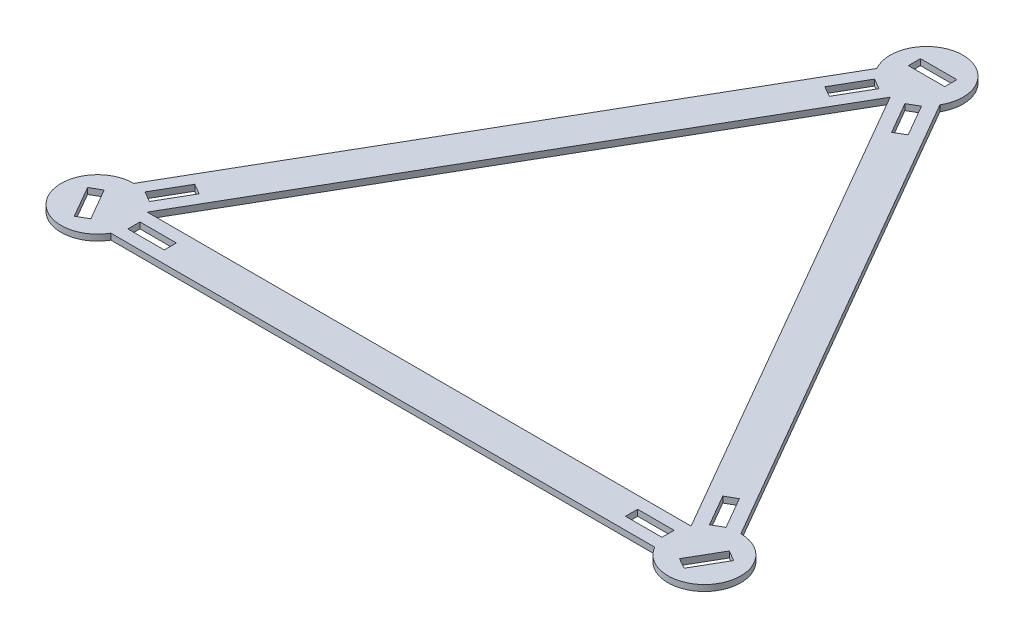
from build123d import *

# Parameters (mm, degrees)
CROQUIS1_W              = 30
CROQUIS1_H              = 10
SALIENTE_EXTRUIR1_DEPTH = 5


with BuildPart() as part:
    # Croquis1 → Saliente-Extruir1 (new body)
    with BuildSketch(Plane(origin=(0, 0, 0), x_dir=(1, 0, 0), z_dir=(0, 1, 0))):
        with BuildLine():
            Line((25.980762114, -15), (474.019237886, -15))
            ThreePointArc((474.019237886, -15), (525.980762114, -15), (500, 30))
            Line((500, 30), (275.980762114, 418.012701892))
            ThreePointArc((275.980762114, 418.012701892), (250, 463.012701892), (224.019237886, 418.012701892))
            Line((224.019237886, 418.012701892), (0, 30))
            ThreePointArc((0, 30), (-25.980762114, -15), (25.980762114, -15))
        make_face()
        Polygon((25.980762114, 15), (474.019237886, 15), (250, 403.012701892), align=None, mode=Mode.SUBTRACT)
        Polygon((230.669872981, 409.531939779), (239.330127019, 404.531939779), (224.330127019, 378.551177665), (215.669872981, 383.551177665), align=None, mode=Mode.SUBTRACT)
        with Locations((250, 438.012701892)):
            Rectangle(CROQUIS1_W, CROQUIS1_H, mode=Mode.SUBTRACT)
        Polygon((284.330127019, 383.551177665), (269.330127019, 409.531939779), (260.669872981, 404.531939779), (275.669872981, 378.551177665), align=None, mode=Mode.SUBTRACT)
        Polygon((489.330127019, 28.480762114), (480.669872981, 23.480762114), (465.669872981, 49.461524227), (474.330127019, 54.461524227), align=None, mode=Mode.SUBTRACT)
        Polygon((516.160254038, 7.990381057), (501.160254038, -17.990381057), (492.5, -12.990381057), (507.5, 12.990381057), align=None, mode=Mode.SUBTRACT)
        with Locations((455, 0)):
            Rectangle(CROQUIS1_W, CROQUIS1_H, mode=Mode.SUBTRACT)
        with Locations((45, 0)):
            Rectangle(CROQUIS1_W, CROQUIS1_H, mode=Mode.SUBTRACT)
        Polygon((-1.160254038, -17.990381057), (-16.160254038, 7.990381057), (-7.5, 12.990381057), (7.5, -12.990381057), align=None, mode=Mode.SUBTRACT)
        Polygon((25.669872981, 54.461524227), (10.669872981, 28.480762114), (19.330127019, 23.480762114), (34.330127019, 49.461524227), align=None, mode=Mode.SUBTRACT)
    extrude(amount=SALIENTE_EXTRUIR1_DEPTH)


solid = part.part
